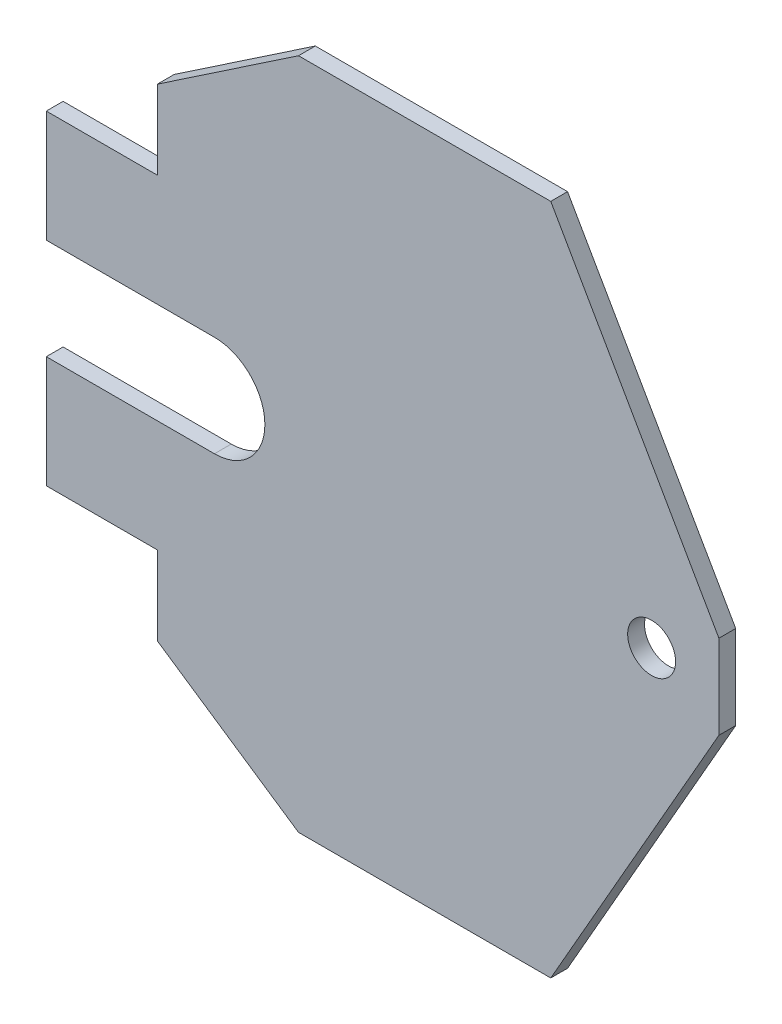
ISO-10303-21;
HEADER;
FILE_DESCRIPTION(('STEP AP214'),'2;1');
FILE_NAME('part.step','',(''),(''),'','','');
FILE_SCHEMA(('AUTOMOTIVE_DESIGN { 1 0 10303 214 1 1 1 1 }'));
ENDSEC;
DATA;
#1=APPLICATION_CONTEXT('core data for automotive mechanical design processes');
#2=APPLICATION_PROTOCOL_DEFINITION('international standard','automotive_design',2000,#1);
#3=PRODUCT_CONTEXT('',#1,'mechanical');
#4=PRODUCT('Part','Part','',(#3));
#5=PRODUCT_RELATED_PRODUCT_CATEGORY('part','',(#4));
#6=PRODUCT_DEFINITION_FORMATION('','',#4);
#7=PRODUCT_DEFINITION_CONTEXT('part definition',#1,'design');
#8=PRODUCT_DEFINITION('design','',#6,#7);
#9=PRODUCT_DEFINITION_SHAPE('','',#8);
#10=(LENGTH_UNIT() NAMED_UNIT(*) SI_UNIT(.MILLI.,.METRE.));
#11=(NAMED_UNIT(*) PLANE_ANGLE_UNIT() SI_UNIT($,.RADIAN.));
#12=(NAMED_UNIT(*) SI_UNIT($,.STERADIAN.) SOLID_ANGLE_UNIT());
#13=UNCERTAINTY_MEASURE_WITH_UNIT(LENGTH_MEASURE(1.E-05),#10,'distance_accuracy_value','');
#14=(GEOMETRIC_REPRESENTATION_CONTEXT(3) GLOBAL_UNCERTAINTY_ASSIGNED_CONTEXT((#13)) GLOBAL_UNIT_ASSIGNED_CONTEXT((#10,
#11,#12)) REPRESENTATION_CONTEXT('',''));
#15=CARTESIAN_POINT('',(0.,0.,0.));
#16=DIRECTION('',(0.,0.,1.));
#17=DIRECTION('',(1.,0.,0.));
#18=AXIS2_PLACEMENT_3D('',#15,#16,#17);
#19=CARTESIAN_POINT('',(-260.,0.,10.));
#20=DIRECTION('',(0.,0.,1.));
#21=DIRECTION('',(1.,0.,0.));
#22=AXIS2_PLACEMENT_3D('',#19,#20,#21);
#23=PLANE('',#22);
#24=CARTESIAN_POINT('',(-260.,0.,10.));
#25=DIRECTION('',(0.,0.,-1.));
#26=DIRECTION('',(1.,0.,0.));
#27=AXIS2_PLACEMENT_3D('',#24,#25,#26);
#28=CIRCLE('',#27,30.);
#29=CARTESIAN_POINT('',(-260.,30.,10.));
#30=VERTEX_POINT('',#29);
#31=CARTESIAN_POINT('',(-260.,-30.,10.));
#32=VERTEX_POINT('',#31);
#33=EDGE_CURVE('E197',#30,#32,#28,.T.);
#34=ORIENTED_EDGE('',*,*,#33,.T.);
#35=DIRECTION('',(-1.,0.,0.));
#36=VECTOR('',#35,1.);
#37=CARTESIAN_POINT('',(-260.,-30.,10.));
#38=LINE('',#37,#36);
#39=CARTESIAN_POINT('',(-360.,-30.,10.));
#40=VERTEX_POINT('',#39);
#41=EDGE_CURVE('E158',#32,#40,#38,.T.);
#42=ORIENTED_EDGE('',*,*,#41,.T.);
#43=DIRECTION('',(0.,-1.,0.));
#44=VECTOR('',#43,1.);
#45=CARTESIAN_POINT('',(-360.,-30.,10.));
#46=LINE('',#45,#44);
#47=CARTESIAN_POINT('',(-360.,-96.5000000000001,10.));
#48=VERTEX_POINT('',#47);
#49=EDGE_CURVE('E200',#40,#48,#46,.T.);
#50=ORIENTED_EDGE('',*,*,#49,.T.);
#51=DIRECTION('',(1.,0.,0.));
#52=VECTOR('',#51,1.);
#53=CARTESIAN_POINT('',(-360.,-96.5000000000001,10.));
#54=LINE('',#53,#52);
#55=CARTESIAN_POINT('',(-294.,-96.5000000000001,10.));
#56=VERTEX_POINT('',#55);
#57=EDGE_CURVE('E202',#48,#56,#54,.T.);
#58=ORIENTED_EDGE('',*,*,#57,.T.);
#59=DIRECTION('',(0.,-1.,0.));
#60=VECTOR('',#59,1.);
#61=CARTESIAN_POINT('',(-294.,-96.5000000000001,10.));
#62=LINE('',#61,#60);
#63=CARTESIAN_POINT('',(-294.,-143.341284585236,10.));
#64=VERTEX_POINT('',#63);
#65=EDGE_CURVE('E204',#56,#64,#62,.T.);
#66=ORIENTED_EDGE('',*,*,#65,.T.);
#67=DIRECTION('',(0.829037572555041,-0.559192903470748,0.));
#68=VECTOR('',#67,1.);
#69=CARTESIAN_POINT('',(-294.,-143.341284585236,10.));
#70=LINE('',#69,#68);
#71=CARTESIAN_POINT('',(-210.,-200.,10.));
#72=VERTEX_POINT('',#71);
#73=EDGE_CURVE('E206',#64,#72,#70,.T.);
#74=ORIENTED_EDGE('',*,*,#73,.T.);
#75=DIRECTION('',(1.,0.,0.));
#76=VECTOR('',#75,1.);
#77=CARTESIAN_POINT('',(-210.,-200.,10.));
#78=LINE('',#77,#76);
#79=CARTESIAN_POINT('',(-60.,-200.,10.));
#80=VERTEX_POINT('',#79);
#81=EDGE_CURVE('E208',#72,#80,#78,.T.);
#82=ORIENTED_EDGE('',*,*,#81,.T.);
#83=DIRECTION('',(0.496138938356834,0.868243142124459,0.));
#84=VECTOR('',#83,1.);
#85=CARTESIAN_POINT('',(40.,-25.,10.));
#86=LINE('',#85,#84);
#87=CARTESIAN_POINT('',(40.,-25.,10.));
#88=VERTEX_POINT('',#87);
#89=EDGE_CURVE('E210',#80,#88,#86,.T.);
#90=ORIENTED_EDGE('',*,*,#89,.T.);
#91=DIRECTION('',(0.,1.,0.));
#92=VECTOR('',#91,1.);
#93=CARTESIAN_POINT('',(40.,25.,10.));
#94=LINE('',#93,#92);
#95=CARTESIAN_POINT('',(40.,25.,10.));
#96=VERTEX_POINT('',#95);
#97=EDGE_CURVE('E212',#88,#96,#94,.T.);
#98=ORIENTED_EDGE('',*,*,#97,.T.);
#99=DIRECTION('',(-0.496138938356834,0.868243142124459,0.));
#100=VECTOR('',#99,1.);
#101=CARTESIAN_POINT('',(-60.,200.,10.));
#102=LINE('',#101,#100);
#103=CARTESIAN_POINT('',(-60.,200.,10.));
#104=VERTEX_POINT('',#103);
#105=EDGE_CURVE('E214',#96,#104,#102,.T.);
#106=ORIENTED_EDGE('',*,*,#105,.T.);
#107=DIRECTION('',(-1.,0.,0.));
#108=VECTOR('',#107,1.);
#109=CARTESIAN_POINT('',(-210.,200.,10.));
#110=LINE('',#109,#108);
#111=CARTESIAN_POINT('',(-210.,200.,10.));
#112=VERTEX_POINT('',#111);
#113=EDGE_CURVE('E216',#104,#112,#110,.T.);
#114=ORIENTED_EDGE('',*,*,#113,.T.);
#115=DIRECTION('',(-0.829037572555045,-0.559192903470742,0.));
#116=VECTOR('',#115,1.);
#117=CARTESIAN_POINT('',(-210.,200.,10.));
#118=LINE('',#117,#116);
#119=CARTESIAN_POINT('',(-294.,143.341284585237,10.));
#120=VERTEX_POINT('',#119);
#121=EDGE_CURVE('E218',#112,#120,#118,.T.);
#122=ORIENTED_EDGE('',*,*,#121,.T.);
#123=DIRECTION('',(0.,-1.,0.));
#124=VECTOR('',#123,1.);
#125=CARTESIAN_POINT('',(-294.,96.4999999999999,10.));
#126=LINE('',#125,#124);
#127=CARTESIAN_POINT('',(-294.,96.4999999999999,10.));
#128=VERTEX_POINT('',#127);
#129=EDGE_CURVE('E220',#120,#128,#126,.T.);
#130=ORIENTED_EDGE('',*,*,#129,.T.);
#131=DIRECTION('',(-1.,0.,0.));
#132=VECTOR('',#131,1.);
#133=CARTESIAN_POINT('',(-360.,96.4999999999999,10.));
#134=LINE('',#133,#132);
#135=CARTESIAN_POINT('',(-360.,96.4999999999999,10.));
#136=VERTEX_POINT('',#135);
#137=EDGE_CURVE('E222',#128,#136,#134,.T.);
#138=ORIENTED_EDGE('',*,*,#137,.T.);
#139=DIRECTION('',(0.,-1.,0.));
#140=VECTOR('',#139,1.);
#141=CARTESIAN_POINT('',(-360.,96.4999999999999,10.));
#142=LINE('',#141,#140);
#143=CARTESIAN_POINT('',(-360.,30.,10.));
#144=VERTEX_POINT('',#143);
#145=EDGE_CURVE('E51',#136,#144,#142,.T.);
#146=ORIENTED_EDGE('',*,*,#145,.T.);
#147=DIRECTION('',(1.,0.,0.));
#148=VECTOR('',#147,1.);
#149=CARTESIAN_POINT('',(-260.,30.,10.));
#150=LINE('',#149,#148);
#151=EDGE_CURVE('E46',#144,#30,#150,.T.);
#152=ORIENTED_EDGE('',*,*,#151,.T.);
#153=EDGE_LOOP('',(#34,#42,#50,#58,#66,#74,#82,#90,#98,#106,#114,#122,#130,#138,#146,#152));
#154=FACE_BOUND('',#153,.T.);
#155=CARTESIAN_POINT('',(0.,0.,10.));
#156=DIRECTION('',(0.,0.,1.));
#157=DIRECTION('',(1.,0.,0.));
#158=AXIS2_PLACEMENT_3D('',#155,#156,#157);
#159=CIRCLE('',#158,14.25);
#160=CARTESIAN_POINT('',(14.25,0.,10.));
#161=VERTEX_POINT('',#160);
#162=EDGE_CURVE('E163',#161,#161,#159,.T.);
#163=ORIENTED_EDGE('',*,*,#162,.F.);
#164=EDGE_LOOP('',(#163));
#165=FACE_BOUND('',#164,.T.);
#166=ADVANCED_FACE('F31',(#154,#165),#23,.T.);
#167=CARTESIAN_POINT('',(-260.,0.,0.));
#168=DIRECTION('',(0.,0.,1.));
#169=DIRECTION('',(1.,0.,0.));
#170=AXIS2_PLACEMENT_3D('',#167,#168,#169);
#171=PLANE('',#170);
#172=CARTESIAN_POINT('',(-260.,0.,0.));
#173=DIRECTION('',(0.,0.,-1.));
#174=DIRECTION('',(1.,0.,0.));
#175=AXIS2_PLACEMENT_3D('',#172,#173,#174);
#176=CIRCLE('',#175,30.);
#177=CARTESIAN_POINT('',(-260.,30.,0.));
#178=VERTEX_POINT('',#177);
#179=CARTESIAN_POINT('',(-260.,-30.,0.));
#180=VERTEX_POINT('',#179);
#181=EDGE_CURVE('E149',#178,#180,#176,.T.);
#182=ORIENTED_EDGE('',*,*,#181,.F.);
#183=DIRECTION('',(1.,0.,0.));
#184=VECTOR('',#183,1.);
#185=CARTESIAN_POINT('',(-260.,30.,0.));
#186=LINE('',#185,#184);
#187=CARTESIAN_POINT('',(-360.,30.,0.));
#188=VERTEX_POINT('',#187);
#189=EDGE_CURVE('E195',#188,#178,#186,.T.);
#190=ORIENTED_EDGE('',*,*,#189,.F.);
#191=DIRECTION('',(0.,-1.,0.));
#192=VECTOR('',#191,1.);
#193=CARTESIAN_POINT('',(-360.,96.4999999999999,0.));
#194=LINE('',#193,#192);
#195=CARTESIAN_POINT('',(-360.,96.4999999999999,0.));
#196=VERTEX_POINT('',#195);
#197=EDGE_CURVE('E193',#196,#188,#194,.T.);
#198=ORIENTED_EDGE('',*,*,#197,.F.);
#199=DIRECTION('',(-1.,0.,0.));
#200=VECTOR('',#199,1.);
#201=CARTESIAN_POINT('',(-360.,96.4999999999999,0.));
#202=LINE('',#201,#200);
#203=CARTESIAN_POINT('',(-294.,96.4999999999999,0.));
#204=VERTEX_POINT('',#203);
#205=EDGE_CURVE('E191',#204,#196,#202,.T.);
#206=ORIENTED_EDGE('',*,*,#205,.F.);
#207=DIRECTION('',(0.,-1.,0.));
#208=VECTOR('',#207,1.);
#209=CARTESIAN_POINT('',(-294.,96.4999999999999,0.));
#210=LINE('',#209,#208);
#211=CARTESIAN_POINT('',(-294.,143.341284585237,0.));
#212=VERTEX_POINT('',#211);
#213=EDGE_CURVE('E189',#212,#204,#210,.T.);
#214=ORIENTED_EDGE('',*,*,#213,.F.);
#215=DIRECTION('',(-0.829037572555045,-0.559192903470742,0.));
#216=VECTOR('',#215,1.);
#217=CARTESIAN_POINT('',(-210.,200.,0.));
#218=LINE('',#217,#216);
#219=CARTESIAN_POINT('',(-210.,200.,0.));
#220=VERTEX_POINT('',#219);
#221=EDGE_CURVE('E187',#220,#212,#218,.T.);
#222=ORIENTED_EDGE('',*,*,#221,.F.);
#223=DIRECTION('',(-1.,0.,0.));
#224=VECTOR('',#223,1.);
#225=CARTESIAN_POINT('',(-210.,200.,0.));
#226=LINE('',#225,#224);
#227=CARTESIAN_POINT('',(-60.,200.,0.));
#228=VERTEX_POINT('',#227);
#229=EDGE_CURVE('E185',#228,#220,#226,.T.);
#230=ORIENTED_EDGE('',*,*,#229,.F.);
#231=DIRECTION('',(-0.496138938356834,0.868243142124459,0.));
#232=VECTOR('',#231,1.);
#233=CARTESIAN_POINT('',(-60.,200.,0.));
#234=LINE('',#233,#232);
#235=CARTESIAN_POINT('',(40.,25.,0.));
#236=VERTEX_POINT('',#235);
#237=EDGE_CURVE('E183',#236,#228,#234,.T.);
#238=ORIENTED_EDGE('',*,*,#237,.F.);
#239=DIRECTION('',(0.,1.,0.));
#240=VECTOR('',#239,1.);
#241=CARTESIAN_POINT('',(40.,25.,0.));
#242=LINE('',#241,#240);
#243=CARTESIAN_POINT('',(40.,-25.,0.));
#244=VERTEX_POINT('',#243);
#245=EDGE_CURVE('E181',#244,#236,#242,.T.);
#246=ORIENTED_EDGE('',*,*,#245,.F.);
#247=DIRECTION('',(0.496138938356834,0.868243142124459,0.));
#248=VECTOR('',#247,1.);
#249=CARTESIAN_POINT('',(40.,-25.,0.));
#250=LINE('',#249,#248);
#251=CARTESIAN_POINT('',(-60.,-200.,0.));
#252=VERTEX_POINT('',#251);
#253=EDGE_CURVE('E179',#252,#244,#250,.T.);
#254=ORIENTED_EDGE('',*,*,#253,.F.);
#255=DIRECTION('',(1.,0.,0.));
#256=VECTOR('',#255,1.);
#257=CARTESIAN_POINT('',(-210.,-200.,0.));
#258=LINE('',#257,#256);
#259=CARTESIAN_POINT('',(-210.,-200.,0.));
#260=VERTEX_POINT('',#259);
#261=EDGE_CURVE('E177',#260,#252,#258,.T.);
#262=ORIENTED_EDGE('',*,*,#261,.F.);
#263=DIRECTION('',(0.829037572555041,-0.559192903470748,0.));
#264=VECTOR('',#263,1.);
#265=CARTESIAN_POINT('',(-294.,-143.341284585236,0.));
#266=LINE('',#265,#264);
#267=CARTESIAN_POINT('',(-294.,-143.341284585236,0.));
#268=VERTEX_POINT('',#267);
#269=EDGE_CURVE('E175',#268,#260,#266,.T.);
#270=ORIENTED_EDGE('',*,*,#269,.F.);
#271=DIRECTION('',(0.,-1.,0.));
#272=VECTOR('',#271,1.);
#273=CARTESIAN_POINT('',(-294.,-96.5000000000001,0.));
#274=LINE('',#273,#272);
#275=CARTESIAN_POINT('',(-294.,-96.5000000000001,0.));
#276=VERTEX_POINT('',#275);
#277=EDGE_CURVE('E173',#276,#268,#274,.T.);
#278=ORIENTED_EDGE('',*,*,#277,.F.);
#279=DIRECTION('',(1.,0.,0.));
#280=VECTOR('',#279,1.);
#281=CARTESIAN_POINT('',(-360.,-96.5000000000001,0.));
#282=LINE('',#281,#280);
#283=CARTESIAN_POINT('',(-360.,-96.5000000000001,0.));
#284=VERTEX_POINT('',#283);
#285=EDGE_CURVE('E171',#284,#276,#282,.T.);
#286=ORIENTED_EDGE('',*,*,#285,.F.);
#287=DIRECTION('',(0.,-1.,0.));
#288=VECTOR('',#287,1.);
#289=CARTESIAN_POINT('',(-360.,-30.,0.));
#290=LINE('',#289,#288);
#291=CARTESIAN_POINT('',(-360.,-30.,0.));
#292=VERTEX_POINT('',#291);
#293=EDGE_CURVE('E151',#292,#284,#290,.T.);
#294=ORIENTED_EDGE('',*,*,#293,.F.);
#295=DIRECTION('',(-1.,0.,0.));
#296=VECTOR('',#295,1.);
#297=CARTESIAN_POINT('',(-260.,-30.,0.));
#298=LINE('',#297,#296);
#299=EDGE_CURVE('E144',#180,#292,#298,.T.);
#300=ORIENTED_EDGE('',*,*,#299,.F.);
#301=EDGE_LOOP('',(#182,#190,#198,#206,#214,#222,#230,#238,#246,#254,#262,#270,#278,#286,#294,#300));
#302=FACE_BOUND('',#301,.T.);
#303=CARTESIAN_POINT('',(0.,0.,0.));
#304=DIRECTION('',(0.,0.,1.));
#305=DIRECTION('',(1.,0.,0.));
#306=AXIS2_PLACEMENT_3D('',#303,#304,#305);
#307=CIRCLE('',#306,14.25);
#308=CARTESIAN_POINT('',(14.25,0.,0.));
#309=VERTEX_POINT('',#308);
#310=EDGE_CURVE('E166',#309,#309,#307,.T.);
#311=ORIENTED_EDGE('',*,*,#310,.T.);
#312=EDGE_LOOP('',(#311));
#313=FACE_BOUND('',#312,.T.);
#314=ADVANCED_FACE('F145',(#302,#313),#171,.F.);
#315=CARTESIAN_POINT('',(-260.,0.,10.));
#316=DIRECTION('',(0.,0.,-1.));
#317=DIRECTION('',(-1.,0.,0.));
#318=AXIS2_PLACEMENT_3D('',#315,#316,#317);
#319=CYLINDRICAL_SURFACE('',#318,30.);
#320=ORIENTED_EDGE('',*,*,#181,.T.);
#321=DIRECTION('',(0.,0.,-1.));
#322=VECTOR('',#321,1.);
#323=CARTESIAN_POINT('',(-260.,-30.,10.));
#324=LINE('',#323,#322);
#325=EDGE_CURVE('E11',#32,#180,#324,.T.);
#326=ORIENTED_EDGE('',*,*,#325,.F.);
#327=ORIENTED_EDGE('',*,*,#33,.F.);
#328=DIRECTION('',(0.,0.,-1.));
#329=VECTOR('',#328,1.);
#330=CARTESIAN_POINT('',(-260.,30.,10.));
#331=LINE('',#330,#329);
#332=EDGE_CURVE('E162',#30,#178,#331,.T.);
#333=ORIENTED_EDGE('',*,*,#332,.T.);
#334=EDGE_LOOP('',(#320,#326,#327,#333));
#335=FACE_BOUND('',#334,.T.);
#336=ADVANCED_FACE('F33',(#335),#319,.F.);
#337=CARTESIAN_POINT('',(-260.,-30.,10.));
#338=DIRECTION('',(0.,-1.,0.));
#339=DIRECTION('',(1.,0.,0.));
#340=AXIS2_PLACEMENT_3D('',#337,#338,#339);
#341=PLANE('',#340);
#342=ORIENTED_EDGE('',*,*,#299,.T.);
#343=DIRECTION('',(0.,0.,-1.));
#344=VECTOR('',#343,1.);
#345=CARTESIAN_POINT('',(-360.,-30.,10.));
#346=LINE('',#345,#344);
#347=EDGE_CURVE('E39',#40,#292,#346,.T.);
#348=ORIENTED_EDGE('',*,*,#347,.F.);
#349=ORIENTED_EDGE('',*,*,#41,.F.);
#350=ORIENTED_EDGE('',*,*,#325,.T.);
#351=EDGE_LOOP('',(#342,#348,#349,#350));
#352=FACE_BOUND('',#351,.T.);
#353=ADVANCED_FACE('F157',(#352),#341,.F.);
#354=CARTESIAN_POINT('',(-360.,-30.,10.));
#355=DIRECTION('',(1.,0.,0.));
#356=DIRECTION('',(0.,0.,-1.));
#357=AXIS2_PLACEMENT_3D('',#354,#355,#356);
#358=PLANE('',#357);
#359=ORIENTED_EDGE('',*,*,#293,.T.);
#360=DIRECTION('',(0.,0.,-1.));
#361=VECTOR('',#360,1.);
#362=CARTESIAN_POINT('',(-360.,-96.5000000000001,10.));
#363=LINE('',#362,#361);
#364=EDGE_CURVE('E263',#48,#284,#363,.T.);
#365=ORIENTED_EDGE('',*,*,#364,.F.);
#366=ORIENTED_EDGE('',*,*,#49,.F.);
#367=ORIENTED_EDGE('',*,*,#347,.T.);
#368=EDGE_LOOP('',(#359,#365,#366,#367));
#369=FACE_BOUND('',#368,.T.);
#370=ADVANCED_FACE('F267',(#369),#358,.F.);
#371=CARTESIAN_POINT('',(-360.,-96.5000000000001,10.));
#372=DIRECTION('',(0.,1.,0.));
#373=DIRECTION('',(0.,0.,1.));
#374=AXIS2_PLACEMENT_3D('',#371,#372,#373);
#375=PLANE('',#374);
#376=ORIENTED_EDGE('',*,*,#285,.T.);
#377=DIRECTION('',(0.,0.,-1.));
#378=VECTOR('',#377,1.);
#379=CARTESIAN_POINT('',(-294.,-96.5000000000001,10.));
#380=LINE('',#379,#378);
#381=EDGE_CURVE('E260',#56,#276,#380,.T.);
#382=ORIENTED_EDGE('',*,*,#381,.F.);
#383=ORIENTED_EDGE('',*,*,#57,.F.);
#384=ORIENTED_EDGE('',*,*,#364,.T.);
#385=EDGE_LOOP('',(#376,#382,#383,#384));
#386=FACE_BOUND('',#385,.T.);
#387=ADVANCED_FACE('F275',(#386),#375,.F.);
#388=CARTESIAN_POINT('',(-294.,-96.5000000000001,10.));
#389=DIRECTION('',(1.,0.,0.));
#390=DIRECTION('',(0.,0.,-1.));
#391=AXIS2_PLACEMENT_3D('',#388,#389,#390);
#392=PLANE('',#391);
#393=ORIENTED_EDGE('',*,*,#277,.T.);
#394=DIRECTION('',(0.,0.,-1.));
#395=VECTOR('',#394,1.);
#396=CARTESIAN_POINT('',(-294.,-143.341284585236,10.));
#397=LINE('',#396,#395);
#398=EDGE_CURVE('E257',#64,#268,#397,.T.);
#399=ORIENTED_EDGE('',*,*,#398,.F.);
#400=ORIENTED_EDGE('',*,*,#65,.F.);
#401=ORIENTED_EDGE('',*,*,#381,.T.);
#402=EDGE_LOOP('',(#393,#399,#400,#401));
#403=FACE_BOUND('',#402,.T.);
#404=ADVANCED_FACE('F278',(#403),#392,.F.);
#405=CARTESIAN_POINT('',(-294.,-143.341284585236,10.));
#406=DIRECTION('',(0.559192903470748,0.829037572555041,0.));
#407=DIRECTION('',(-0.829037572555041,0.559192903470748,0.));
#408=AXIS2_PLACEMENT_3D('',#405,#406,#407);
#409=PLANE('',#408);
#410=ORIENTED_EDGE('',*,*,#269,.T.);
#411=DIRECTION('',(0.,0.,-1.));
#412=VECTOR('',#411,1.);
#413=CARTESIAN_POINT('',(-210.,-200.,10.));
#414=LINE('',#413,#412);
#415=EDGE_CURVE('E254',#72,#260,#414,.T.);
#416=ORIENTED_EDGE('',*,*,#415,.F.);
#417=ORIENTED_EDGE('',*,*,#73,.F.);
#418=ORIENTED_EDGE('',*,*,#398,.T.);
#419=EDGE_LOOP('',(#410,#416,#417,#418));
#420=FACE_BOUND('',#419,.T.);
#421=ADVANCED_FACE('F283',(#420),#409,.F.);
#422=CARTESIAN_POINT('',(-210.,-200.,10.));
#423=DIRECTION('',(0.,1.,0.));
#424=DIRECTION('',(-1.,0.,0.));
#425=AXIS2_PLACEMENT_3D('',#422,#423,#424);
#426=PLANE('',#425);
#427=ORIENTED_EDGE('',*,*,#261,.T.);
#428=DIRECTION('',(0.,0.,-1.));
#429=VECTOR('',#428,1.);
#430=CARTESIAN_POINT('',(-60.,-200.,10.));
#431=LINE('',#430,#429);
#432=EDGE_CURVE('E251',#80,#252,#431,.T.);
#433=ORIENTED_EDGE('',*,*,#432,.F.);
#434=ORIENTED_EDGE('',*,*,#81,.F.);
#435=ORIENTED_EDGE('',*,*,#415,.T.);
#436=EDGE_LOOP('',(#427,#433,#434,#435));
#437=FACE_BOUND('',#436,.T.);
#438=ADVANCED_FACE('F289',(#437),#426,.F.);
#439=CARTESIAN_POINT('',(40.,-25.,10.));
#440=DIRECTION('',(-0.868243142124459,0.496138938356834,0.));
#441=DIRECTION('',(-0.496138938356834,-0.868243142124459,0.));
#442=AXIS2_PLACEMENT_3D('',#439,#440,#441);
#443=PLANE('',#442);
#444=ORIENTED_EDGE('',*,*,#253,.T.);
#445=DIRECTION('',(0.,0.,-1.));
#446=VECTOR('',#445,1.);
#447=CARTESIAN_POINT('',(40.,-25.,10.));
#448=LINE('',#447,#446);
#449=EDGE_CURVE('E248',#88,#244,#448,.T.);
#450=ORIENTED_EDGE('',*,*,#449,.F.);
#451=ORIENTED_EDGE('',*,*,#89,.F.);
#452=ORIENTED_EDGE('',*,*,#432,.T.);
#453=EDGE_LOOP('',(#444,#450,#451,#452));
#454=FACE_BOUND('',#453,.T.);
#455=ADVANCED_FACE('F293',(#454),#443,.F.);
#456=CARTESIAN_POINT('',(40.,25.,10.));
#457=DIRECTION('',(-1.,0.,0.));
#458=DIRECTION('',(0.,-1.,0.));
#459=AXIS2_PLACEMENT_3D('',#456,#457,#458);
#460=PLANE('',#459);
#461=ORIENTED_EDGE('',*,*,#245,.T.);
#462=DIRECTION('',(0.,0.,-1.));
#463=VECTOR('',#462,1.);
#464=CARTESIAN_POINT('',(40.,25.,10.));
#465=LINE('',#464,#463);
#466=EDGE_CURVE('E245',#96,#236,#465,.T.);
#467=ORIENTED_EDGE('',*,*,#466,.F.);
#468=ORIENTED_EDGE('',*,*,#97,.F.);
#469=ORIENTED_EDGE('',*,*,#449,.T.);
#470=EDGE_LOOP('',(#461,#467,#468,#469));
#471=FACE_BOUND('',#470,.T.);
#472=ADVANCED_FACE('F298',(#471),#460,.F.);
#473=CARTESIAN_POINT('',(-60.,200.,10.));
#474=DIRECTION('',(-0.868243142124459,-0.496138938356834,0.));
#475=DIRECTION('',(0.496138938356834,-0.868243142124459,0.));
#476=AXIS2_PLACEMENT_3D('',#473,#474,#475);
#477=PLANE('',#476);
#478=ORIENTED_EDGE('',*,*,#237,.T.);
#479=DIRECTION('',(0.,0.,-1.));
#480=VECTOR('',#479,1.);
#481=CARTESIAN_POINT('',(-60.,200.,10.));
#482=LINE('',#481,#480);
#483=EDGE_CURVE('E242',#104,#228,#482,.T.);
#484=ORIENTED_EDGE('',*,*,#483,.F.);
#485=ORIENTED_EDGE('',*,*,#105,.F.);
#486=ORIENTED_EDGE('',*,*,#466,.T.);
#487=EDGE_LOOP('',(#478,#484,#485,#486));
#488=FACE_BOUND('',#487,.T.);
#489=ADVANCED_FACE('F304',(#488),#477,.F.);
#490=CARTESIAN_POINT('',(-210.,200.,10.));
#491=DIRECTION('',(0.,-1.,0.));
#492=DIRECTION('',(0.,0.,-1.));
#493=AXIS2_PLACEMENT_3D('',#490,#491,#492);
#494=PLANE('',#493);
#495=ORIENTED_EDGE('',*,*,#229,.T.);
#496=DIRECTION('',(0.,0.,-1.));
#497=VECTOR('',#496,1.);
#498=CARTESIAN_POINT('',(-210.,200.,10.));
#499=LINE('',#498,#497);
#500=EDGE_CURVE('E239',#112,#220,#499,.T.);
#501=ORIENTED_EDGE('',*,*,#500,.F.);
#502=ORIENTED_EDGE('',*,*,#113,.F.);
#503=ORIENTED_EDGE('',*,*,#483,.T.);
#504=EDGE_LOOP('',(#495,#501,#502,#503));
#505=FACE_BOUND('',#504,.T.);
#506=ADVANCED_FACE('F308',(#505),#494,.F.);
#507=CARTESIAN_POINT('',(-210.,200.,10.));
#508=DIRECTION('',(0.559192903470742,-0.829037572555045,0.));
#509=DIRECTION('',(0.829037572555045,0.559192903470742,0.));
#510=AXIS2_PLACEMENT_3D('',#507,#508,#509);
#511=PLANE('',#510);
#512=ORIENTED_EDGE('',*,*,#221,.T.);
#513=DIRECTION('',(0.,0.,-1.));
#514=VECTOR('',#513,1.);
#515=CARTESIAN_POINT('',(-294.,143.341284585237,10.));
#516=LINE('',#515,#514);
#517=EDGE_CURVE('E236',#120,#212,#516,.T.);
#518=ORIENTED_EDGE('',*,*,#517,.F.);
#519=ORIENTED_EDGE('',*,*,#121,.F.);
#520=ORIENTED_EDGE('',*,*,#500,.T.);
#521=EDGE_LOOP('',(#512,#518,#519,#520));
#522=FACE_BOUND('',#521,.T.);
#523=ADVANCED_FACE('F313',(#522),#511,.F.);
#524=CARTESIAN_POINT('',(-294.,96.4999999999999,10.));
#525=DIRECTION('',(1.,0.,0.));
#526=DIRECTION('',(0.,0.,-1.));
#527=AXIS2_PLACEMENT_3D('',#524,#525,#526);
#528=PLANE('',#527);
#529=ORIENTED_EDGE('',*,*,#213,.T.);
#530=DIRECTION('',(0.,0.,-1.));
#531=VECTOR('',#530,1.);
#532=CARTESIAN_POINT('',(-294.,96.4999999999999,10.));
#533=LINE('',#532,#531);
#534=EDGE_CURVE('E233',#128,#204,#533,.T.);
#535=ORIENTED_EDGE('',*,*,#534,.F.);
#536=ORIENTED_EDGE('',*,*,#129,.F.);
#537=ORIENTED_EDGE('',*,*,#517,.T.);
#538=EDGE_LOOP('',(#529,#535,#536,#537));
#539=FACE_BOUND('',#538,.T.);
#540=ADVANCED_FACE('F319',(#539),#528,.F.);
#541=CARTESIAN_POINT('',(-360.,96.4999999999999,10.));
#542=DIRECTION('',(0.,-1.,0.));
#543=DIRECTION('',(0.,0.,-1.));
#544=AXIS2_PLACEMENT_3D('',#541,#542,#543);
#545=PLANE('',#544);
#546=ORIENTED_EDGE('',*,*,#205,.T.);
#547=DIRECTION('',(0.,0.,-1.));
#548=VECTOR('',#547,1.);
#549=CARTESIAN_POINT('',(-360.,96.4999999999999,10.));
#550=LINE('',#549,#548);
#551=EDGE_CURVE('E230',#136,#196,#550,.T.);
#552=ORIENTED_EDGE('',*,*,#551,.F.);
#553=ORIENTED_EDGE('',*,*,#137,.F.);
#554=ORIENTED_EDGE('',*,*,#534,.T.);
#555=EDGE_LOOP('',(#546,#552,#553,#554));
#556=FACE_BOUND('',#555,.T.);
#557=ADVANCED_FACE('F323',(#556),#545,.F.);
#558=CARTESIAN_POINT('',(-360.,96.4999999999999,10.));
#559=DIRECTION('',(1.,0.,0.));
#560=DIRECTION('',(0.,0.,-1.));
#561=AXIS2_PLACEMENT_3D('',#558,#559,#560);
#562=PLANE('',#561);
#563=ORIENTED_EDGE('',*,*,#197,.T.);
#564=DIRECTION('',(0.,0.,-1.));
#565=VECTOR('',#564,1.);
#566=CARTESIAN_POINT('',(-360.,30.,10.));
#567=LINE('',#566,#565);
#568=EDGE_CURVE('E227',#144,#188,#567,.T.);
#569=ORIENTED_EDGE('',*,*,#568,.F.);
#570=ORIENTED_EDGE('',*,*,#145,.F.);
#571=ORIENTED_EDGE('',*,*,#551,.T.);
#572=EDGE_LOOP('',(#563,#569,#570,#571));
#573=FACE_BOUND('',#572,.T.);
#574=ADVANCED_FACE('F326',(#573),#562,.F.);
#575=CARTESIAN_POINT('',(-260.,30.,10.));
#576=DIRECTION('',(0.,1.,0.));
#577=DIRECTION('',(-1.,0.,0.));
#578=AXIS2_PLACEMENT_3D('',#575,#576,#577);
#579=PLANE('',#578);
#580=ORIENTED_EDGE('',*,*,#189,.T.);
#581=ORIENTED_EDGE('',*,*,#332,.F.);
#582=ORIENTED_EDGE('',*,*,#151,.F.);
#583=ORIENTED_EDGE('',*,*,#568,.T.);
#584=EDGE_LOOP('',(#580,#581,#582,#583));
#585=FACE_BOUND('',#584,.T.);
#586=ADVANCED_FACE('F328',(#585),#579,.F.);
#587=CARTESIAN_POINT('',(0.,0.,10.));
#588=DIRECTION('',(0.,0.,-1.));
#589=DIRECTION('',(-1.,0.,0.));
#590=AXIS2_PLACEMENT_3D('',#587,#588,#589);
#591=CYLINDRICAL_SURFACE('',#590,14.25);
#592=ORIENTED_EDGE('',*,*,#162,.T.);
#593=EDGE_LOOP('',(#592));
#594=FACE_BOUND('',#593,.T.);
#595=ORIENTED_EDGE('',*,*,#310,.F.);
#596=EDGE_LOOP('',(#595));
#597=FACE_BOUND('',#596,.T.);
#598=ADVANCED_FACE('F330',(#594,#597),#591,.F.);
#599=CLOSED_SHELL('',(#166,#314,#336,#353,#370,#387,#404,#421,#438,#455,#472,#489,#506,#523,
#540,#557,#574,#586,#598));
#600=MANIFOLD_SOLID_BREP('B2',#599);
#601=ADVANCED_BREP_SHAPE_REPRESENTATION('',(#18,#600),#14);
#602=SHAPE_DEFINITION_REPRESENTATION(#9,#601);
ENDSEC;
END-ISO-10303-21;
